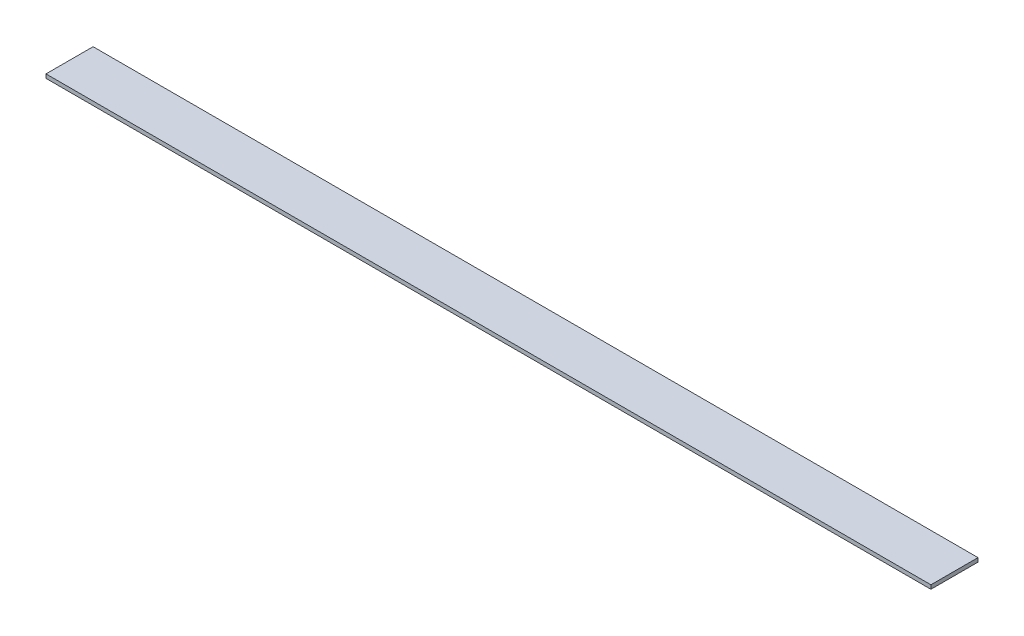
from build123d import *

# Parameters (mm, degrees)
SKETCH1_W           = 1431.925
SKETCH1_H           = 76.2
BOSS_EXTRUDE1_DEPTH = 6.35


with BuildPart() as part:
    # Sketch1 → Boss-Extrude1 (new body)
    with BuildSketch(Plane(origin=(0, 0, 0), x_dir=(1, 0, 0), z_dir=(0, 1, 0))):
        Rectangle(SKETCH1_W, SKETCH1_H)
    extrude(amount=BOSS_EXTRUDE1_DEPTH)


solid = part.part
